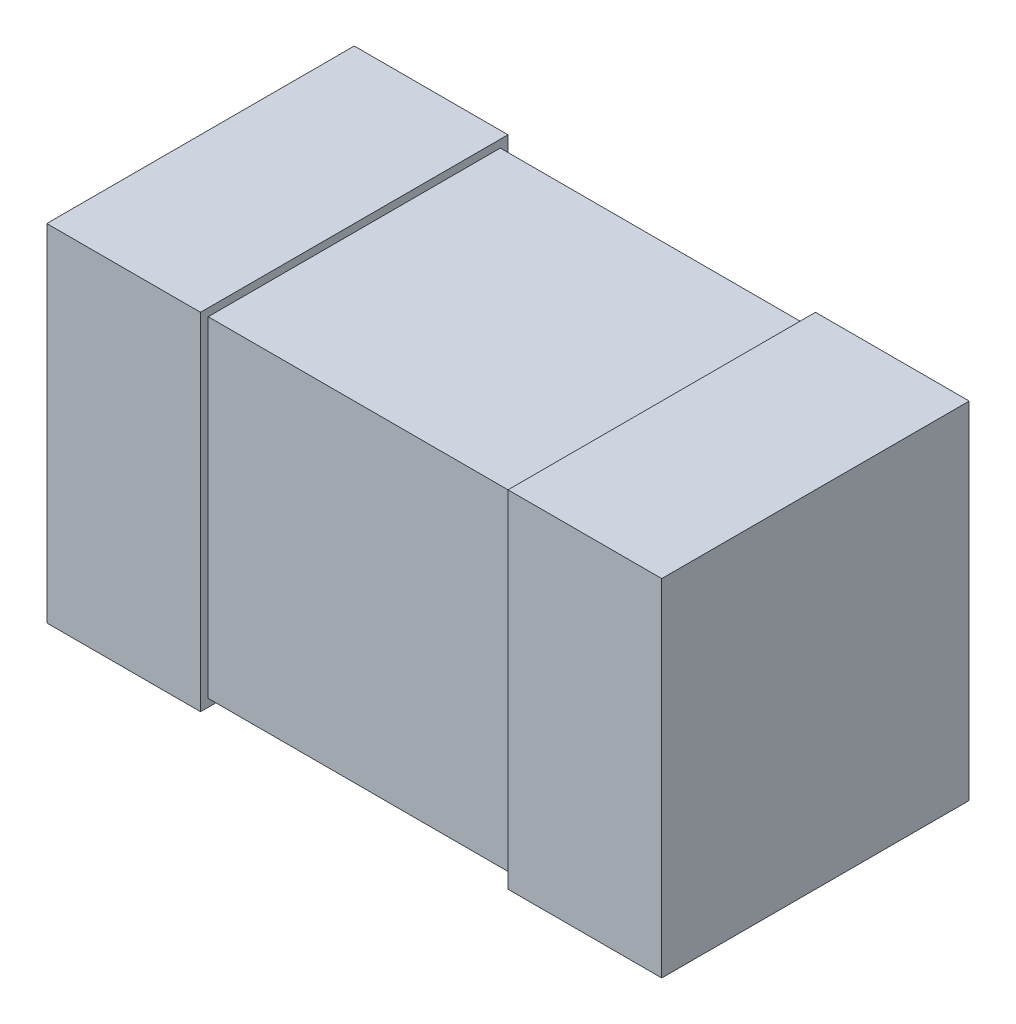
ISO-10303-21;
HEADER;
FILE_DESCRIPTION(('STEP AP214'),'2;1');
FILE_NAME('part.step','',(''),(''),'','','');
FILE_SCHEMA(('AUTOMOTIVE_DESIGN { 1 0 10303 214 1 1 1 1 }'));
ENDSEC;
DATA;
#1=APPLICATION_CONTEXT('core data for automotive mechanical design processes');
#2=APPLICATION_PROTOCOL_DEFINITION('international standard','automotive_design',2000,#1);
#3=PRODUCT_CONTEXT('',#1,'mechanical');
#4=PRODUCT('Part','Part','',(#3));
#5=PRODUCT_RELATED_PRODUCT_CATEGORY('part','',(#4));
#6=PRODUCT_DEFINITION_FORMATION('','',#4);
#7=PRODUCT_DEFINITION_CONTEXT('part definition',#1,'design');
#8=PRODUCT_DEFINITION('design','',#6,#7);
#9=PRODUCT_DEFINITION_SHAPE('','',#8);
#10=(LENGTH_UNIT() NAMED_UNIT(*) SI_UNIT(.MILLI.,.METRE.));
#11=(NAMED_UNIT(*) PLANE_ANGLE_UNIT() SI_UNIT($,.RADIAN.));
#12=(NAMED_UNIT(*) SI_UNIT($,.STERADIAN.) SOLID_ANGLE_UNIT());
#13=UNCERTAINTY_MEASURE_WITH_UNIT(LENGTH_MEASURE(1.E-05),#10,'distance_accuracy_value','');
#14=(GEOMETRIC_REPRESENTATION_CONTEXT(3) GLOBAL_UNCERTAINTY_ASSIGNED_CONTEXT((#13)) GLOBAL_UNIT_ASSIGNED_CONTEXT((#10,
#11,#12)) REPRESENTATION_CONTEXT('',''));
#15=CARTESIAN_POINT('',(0.,0.,0.));
#16=DIRECTION('',(0.,0.,1.));
#17=DIRECTION('',(1.,0.,0.));
#18=AXIS2_PLACEMENT_3D('',#15,#16,#17);
#19=CARTESIAN_POINT('',(-0.4,0.9,0.4));
#20=DIRECTION('',(-1.,0.,0.));
#21=DIRECTION('',(0.,0.,1.));
#22=AXIS2_PLACEMENT_3D('',#19,#20,#21);
#23=PLANE('',#22);
#24=DIRECTION('',(0.,0.,-1.));
#25=VECTOR('',#24,1.);
#26=CARTESIAN_POINT('',(-0.4,0.,0.4));
#27=LINE('',#26,#25);
#28=CARTESIAN_POINT('',(-0.4,0.,0.4));
#29=VERTEX_POINT('',#28);
#30=CARTESIAN_POINT('',(-0.4,0.,-0.4));
#31=VERTEX_POINT('',#30);
#32=EDGE_CURVE('E194',#29,#31,#27,.T.);
#33=ORIENTED_EDGE('',*,*,#32,.T.);
#34=DIRECTION('',(0.,-1.,0.));
#35=VECTOR('',#34,1.);
#36=CARTESIAN_POINT('',(-0.4,0.9,-0.4));
#37=LINE('',#36,#35);
#38=CARTESIAN_POINT('',(-0.4,0.9,-0.4));
#39=VERTEX_POINT('',#38);
#40=EDGE_CURVE('E199',#39,#31,#37,.T.);
#41=ORIENTED_EDGE('',*,*,#40,.F.);
#42=DIRECTION('',(0.,0.,-1.));
#43=VECTOR('',#42,1.);
#44=CARTESIAN_POINT('',(-0.4,0.9,0.4));
#45=LINE('',#44,#43);
#46=CARTESIAN_POINT('',(-0.4,0.9,0.4));
#47=VERTEX_POINT('',#46);
#48=EDGE_CURVE('E185',#47,#39,#45,.T.);
#49=ORIENTED_EDGE('',*,*,#48,.F.);
#50=DIRECTION('',(0.,-1.,0.));
#51=VECTOR('',#50,1.);
#52=CARTESIAN_POINT('',(-0.4,0.9,0.4));
#53=LINE('',#52,#51);
#54=EDGE_CURVE('E38',#47,#29,#53,.T.);
#55=ORIENTED_EDGE('',*,*,#54,.T.);
#56=EDGE_LOOP('',(#33,#41,#49,#55));
#57=FACE_BOUND('',#56,.T.);
#58=DIRECTION('',(0.,-1.,0.));
#59=VECTOR('',#58,1.);
#60=CARTESIAN_POINT('',(-0.4,0.88,0.38));
#61=LINE('',#60,#59);
#62=CARTESIAN_POINT('',(-0.4,0.88,0.38));
#63=VERTEX_POINT('',#62);
#64=CARTESIAN_POINT('',(-0.4,0.0200000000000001,0.38));
#65=VERTEX_POINT('',#64);
#66=EDGE_CURVE('E146',#63,#65,#61,.T.);
#67=ORIENTED_EDGE('',*,*,#66,.F.);
#68=DIRECTION('',(0.,0.,1.));
#69=VECTOR('',#68,1.);
#70=CARTESIAN_POINT('',(-0.4,0.88,-0.38));
#71=LINE('',#70,#69);
#72=CARTESIAN_POINT('',(-0.4,0.88,-0.38));
#73=VERTEX_POINT('',#72);
#74=EDGE_CURVE('E152',#73,#63,#71,.T.);
#75=ORIENTED_EDGE('',*,*,#74,.F.);
#76=DIRECTION('',(0.,1.,0.));
#77=VECTOR('',#76,1.);
#78=CARTESIAN_POINT('',(-0.4,0.0200000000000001,-0.38));
#79=LINE('',#78,#77);
#80=CARTESIAN_POINT('',(-0.4,0.0200000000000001,-0.38));
#81=VERTEX_POINT('',#80);
#82=EDGE_CURVE('E50',#81,#73,#79,.T.);
#83=ORIENTED_EDGE('',*,*,#82,.F.);
#84=DIRECTION('',(0.,0.,-1.));
#85=VECTOR('',#84,1.);
#86=CARTESIAN_POINT('',(-0.4,0.02,0.38));
#87=LINE('',#86,#85);
#88=EDGE_CURVE('E45',#65,#81,#87,.T.);
#89=ORIENTED_EDGE('',*,*,#88,.F.);
#90=EDGE_LOOP('',(#67,#75,#83,#89));
#91=FACE_BOUND('',#90,.T.);
#92=ADVANCED_FACE('F30',(#57,#91),#23,.F.);
#93=CARTESIAN_POINT('',(-0.8,0.9,0.4));
#94=DIRECTION('',(1.,0.,0.));
#95=DIRECTION('',(0.,0.,-1.));
#96=AXIS2_PLACEMENT_3D('',#93,#94,#95);
#97=PLANE('',#96);
#98=DIRECTION('',(0.,0.,1.));
#99=VECTOR('',#98,1.);
#100=CARTESIAN_POINT('',(-0.8,0.,0.4));
#101=LINE('',#100,#99);
#102=CARTESIAN_POINT('',(-0.8,0.,-0.4));
#103=VERTEX_POINT('',#102);
#104=CARTESIAN_POINT('',(-0.8,0.,0.4));
#105=VERTEX_POINT('',#104);
#106=EDGE_CURVE('E166',#103,#105,#101,.T.);
#107=ORIENTED_EDGE('',*,*,#106,.T.);
#108=DIRECTION('',(0.,-1.,0.));
#109=VECTOR('',#108,1.);
#110=CARTESIAN_POINT('',(-0.8,0.9,0.4));
#111=LINE('',#110,#109);
#112=CARTESIAN_POINT('',(-0.8,0.9,0.4));
#113=VERTEX_POINT('',#112);
#114=EDGE_CURVE('E11',#113,#105,#111,.T.);
#115=ORIENTED_EDGE('',*,*,#114,.F.);
#116=DIRECTION('',(0.,0.,1.));
#117=VECTOR('',#116,1.);
#118=CARTESIAN_POINT('',(-0.8,0.9,0.4));
#119=LINE('',#118,#117);
#120=CARTESIAN_POINT('',(-0.8,0.9,-0.4));
#121=VERTEX_POINT('',#120);
#122=EDGE_CURVE('E179',#121,#113,#119,.T.);
#123=ORIENTED_EDGE('',*,*,#122,.F.);
#124=DIRECTION('',(0.,-1.,0.));
#125=VECTOR('',#124,1.);
#126=CARTESIAN_POINT('',(-0.8,0.9,-0.4));
#127=LINE('',#126,#125);
#128=EDGE_CURVE('E189',#121,#103,#127,.T.);
#129=ORIENTED_EDGE('',*,*,#128,.T.);
#130=EDGE_LOOP('',(#107,#115,#123,#129));
#131=FACE_BOUND('',#130,.T.);
#132=ADVANCED_FACE('F32',(#131),#97,.F.);
#133=CARTESIAN_POINT('',(-0.8,0.9,0.4));
#134=DIRECTION('',(0.,0.,-1.));
#135=DIRECTION('',(-1.,0.,0.));
#136=AXIS2_PLACEMENT_3D('',#133,#134,#135);
#137=PLANE('',#136);
#138=DIRECTION('',(1.,0.,0.));
#139=VECTOR('',#138,1.);
#140=CARTESIAN_POINT('',(-0.8,0.,0.4));
#141=LINE('',#140,#139);
#142=EDGE_CURVE('E192',#105,#29,#141,.T.);
#143=ORIENTED_EDGE('',*,*,#142,.T.);
#144=ORIENTED_EDGE('',*,*,#54,.F.);
#145=DIRECTION('',(1.,0.,0.));
#146=VECTOR('',#145,1.);
#147=CARTESIAN_POINT('',(-0.8,0.9,0.4));
#148=LINE('',#147,#146);
#149=EDGE_CURVE('E182',#113,#47,#148,.T.);
#150=ORIENTED_EDGE('',*,*,#149,.F.);
#151=ORIENTED_EDGE('',*,*,#114,.T.);
#152=EDGE_LOOP('',(#143,#144,#150,#151));
#153=FACE_BOUND('',#152,.T.);
#154=ADVANCED_FACE('F221',(#153),#137,.F.);
#155=CARTESIAN_POINT('',(-0.8,0.9,-0.4));
#156=DIRECTION('',(0.,0.,1.));
#157=DIRECTION('',(1.,0.,0.));
#158=AXIS2_PLACEMENT_3D('',#155,#156,#157);
#159=PLANE('',#158);
#160=DIRECTION('',(-1.,0.,0.));
#161=VECTOR('',#160,1.);
#162=CARTESIAN_POINT('',(-0.8,0.,-0.4));
#163=LINE('',#162,#161);
#164=EDGE_CURVE('E183',#31,#103,#163,.T.);
#165=ORIENTED_EDGE('',*,*,#164,.T.);
#166=ORIENTED_EDGE('',*,*,#128,.F.);
#167=DIRECTION('',(-1.,0.,0.));
#168=VECTOR('',#167,1.);
#169=CARTESIAN_POINT('',(-0.8,0.9,-0.4));
#170=LINE('',#169,#168);
#171=EDGE_CURVE('E187',#39,#121,#170,.T.);
#172=ORIENTED_EDGE('',*,*,#171,.F.);
#173=ORIENTED_EDGE('',*,*,#40,.T.);
#174=EDGE_LOOP('',(#165,#166,#172,#173));
#175=FACE_BOUND('',#174,.T.);
#176=ADVANCED_FACE('F214',(#175),#159,.F.);
#177=CARTESIAN_POINT('',(-0.8,0.9,-0.4));
#178=DIRECTION('',(0.,-1.,0.));
#179=DIRECTION('',(0.,0.,-1.));
#180=AXIS2_PLACEMENT_3D('',#177,#178,#179);
#181=PLANE('',#180);
#182=ORIENTED_EDGE('',*,*,#122,.T.);
#183=ORIENTED_EDGE('',*,*,#149,.T.);
#184=ORIENTED_EDGE('',*,*,#48,.T.);
#185=ORIENTED_EDGE('',*,*,#171,.T.);
#186=EDGE_LOOP('',(#182,#183,#184,#185));
#187=FACE_BOUND('',#186,.T.);
#188=ADVANCED_FACE('F220',(#187),#181,.F.);
#189=CARTESIAN_POINT('',(-0.8,0.,-0.4));
#190=DIRECTION('',(0.,-1.,0.));
#191=DIRECTION('',(0.,0.,-1.));
#192=AXIS2_PLACEMENT_3D('',#189,#190,#191);
#193=PLANE('',#192);
#194=ORIENTED_EDGE('',*,*,#106,.F.);
#195=ORIENTED_EDGE('',*,*,#164,.F.);
#196=ORIENTED_EDGE('',*,*,#32,.F.);
#197=ORIENTED_EDGE('',*,*,#142,.F.);
#198=EDGE_LOOP('',(#194,#195,#196,#197));
#199=FACE_BOUND('',#198,.T.);
#200=ADVANCED_FACE('F211',(#199),#193,.T.);
#201=CARTESIAN_POINT('',(1.54769333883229,0.88,0.38));
#202=DIRECTION('',(0.,0.,-1.));
#203=DIRECTION('',(0.,1.,0.));
#204=AXIS2_PLACEMENT_3D('',#201,#202,#203);
#205=PLANE('',#204);
#206=DIRECTION('',(0.,-1.,0.));
#207=VECTOR('',#206,1.);
#208=CARTESIAN_POINT('',(0.4,0.88,0.38));
#209=LINE('',#208,#207);
#210=CARTESIAN_POINT('',(0.4,0.88,0.38));
#211=VERTEX_POINT('',#210);
#212=CARTESIAN_POINT('',(0.4,0.02,0.38));
#213=VERTEX_POINT('',#212);
#214=EDGE_CURVE('E170',#211,#213,#209,.T.);
#215=ORIENTED_EDGE('',*,*,#214,.F.);
#216=DIRECTION('',(-1.,0.,0.));
#217=VECTOR('',#216,1.);
#218=CARTESIAN_POINT('',(1.54769333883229,0.88,0.38));
#219=LINE('',#218,#217);
#220=EDGE_CURVE('E143',#211,#63,#219,.T.);
#221=ORIENTED_EDGE('',*,*,#220,.T.);
#222=ORIENTED_EDGE('',*,*,#66,.T.);
#223=DIRECTION('',(-1.,0.,0.));
#224=VECTOR('',#223,1.);
#225=CARTESIAN_POINT('',(1.54769333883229,0.02,0.38));
#226=LINE('',#225,#224);
#227=EDGE_CURVE('E160',#213,#65,#226,.T.);
#228=ORIENTED_EDGE('',*,*,#227,.F.);
#229=EDGE_LOOP('',(#215,#221,#222,#228));
#230=FACE_BOUND('',#229,.T.);
#231=ADVANCED_FACE('F235',(#230),#205,.F.);
#232=CARTESIAN_POINT('',(1.54769333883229,0.02,0.38));
#233=DIRECTION('',(0.,1.,0.));
#234=DIRECTION('',(0.,0.,1.));
#235=AXIS2_PLACEMENT_3D('',#232,#233,#234);
#236=PLANE('',#235);
#237=DIRECTION('',(0.,0.,-1.));
#238=VECTOR('',#237,1.);
#239=CARTESIAN_POINT('',(0.4,0.02,0.38));
#240=LINE('',#239,#238);
#241=CARTESIAN_POINT('',(0.4,0.0200000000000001,-0.38));
#242=VERTEX_POINT('',#241);
#243=EDGE_CURVE('E167',#213,#242,#240,.T.);
#244=ORIENTED_EDGE('',*,*,#243,.F.);
#245=ORIENTED_EDGE('',*,*,#227,.T.);
#246=ORIENTED_EDGE('',*,*,#88,.T.);
#247=DIRECTION('',(-1.,0.,0.));
#248=VECTOR('',#247,1.);
#249=CARTESIAN_POINT('',(1.54769333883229,0.0200000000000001,-0.38));
#250=LINE('',#249,#248);
#251=EDGE_CURVE('E158',#242,#81,#250,.T.);
#252=ORIENTED_EDGE('',*,*,#251,.F.);
#253=EDGE_LOOP('',(#244,#245,#246,#252));
#254=FACE_BOUND('',#253,.T.);
#255=ADVANCED_FACE('F240',(#254),#236,.F.);
#256=CARTESIAN_POINT('',(1.54769333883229,0.0200000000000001,-0.38));
#257=DIRECTION('',(0.,0.,1.));
#258=DIRECTION('',(1.,0.,0.));
#259=AXIS2_PLACEMENT_3D('',#256,#257,#258);
#260=PLANE('',#259);
#261=DIRECTION('',(0.,1.,0.));
#262=VECTOR('',#261,1.);
#263=CARTESIAN_POINT('',(0.4,0.0200000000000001,-0.38));
#264=LINE('',#263,#262);
#265=CARTESIAN_POINT('',(0.4,0.88,-0.38));
#266=VERTEX_POINT('',#265);
#267=EDGE_CURVE('E163',#242,#266,#264,.T.);
#268=ORIENTED_EDGE('',*,*,#267,.F.);
#269=ORIENTED_EDGE('',*,*,#251,.T.);
#270=ORIENTED_EDGE('',*,*,#82,.T.);
#271=DIRECTION('',(-1.,0.,0.));
#272=VECTOR('',#271,1.);
#273=CARTESIAN_POINT('',(1.54769333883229,0.88,-0.38));
#274=LINE('',#273,#272);
#275=EDGE_CURVE('E156',#266,#73,#274,.T.);
#276=ORIENTED_EDGE('',*,*,#275,.F.);
#277=EDGE_LOOP('',(#268,#269,#270,#276));
#278=FACE_BOUND('',#277,.T.);
#279=ADVANCED_FACE('F244',(#278),#260,.F.);
#280=CARTESIAN_POINT('',(1.54769333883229,0.88,-0.38));
#281=DIRECTION('',(0.,-1.,0.));
#282=DIRECTION('',(0.,0.,-1.));
#283=AXIS2_PLACEMENT_3D('',#280,#281,#282);
#284=PLANE('',#283);
#285=DIRECTION('',(0.,0.,1.));
#286=VECTOR('',#285,1.);
#287=CARTESIAN_POINT('',(0.4,0.88,-0.38));
#288=LINE('',#287,#286);
#289=EDGE_CURVE('E155',#266,#211,#288,.T.);
#290=ORIENTED_EDGE('',*,*,#289,.F.);
#291=ORIENTED_EDGE('',*,*,#275,.T.);
#292=ORIENTED_EDGE('',*,*,#74,.T.);
#293=ORIENTED_EDGE('',*,*,#220,.F.);
#294=EDGE_LOOP('',(#290,#291,#292,#293));
#295=FACE_BOUND('',#294,.T.);
#296=ADVANCED_FACE('F248',(#295),#284,.F.);
#297=CARTESIAN_POINT('',(0.4,0.9,0.4));
#298=DIRECTION('',(1.,0.,0.));
#299=DIRECTION('',(0.,0.,-1.));
#300=AXIS2_PLACEMENT_3D('',#297,#298,#299);
#301=PLANE('',#300);
#302=DIRECTION('',(0.,0.,1.));
#303=VECTOR('',#302,1.);
#304=CARTESIAN_POINT('',(0.4,0.,0.4));
#305=LINE('',#304,#303);
#306=CARTESIAN_POINT('',(0.4,0.,-0.4));
#307=VERTEX_POINT('',#306);
#308=CARTESIAN_POINT('',(0.4,0.,0.4));
#309=VERTEX_POINT('',#308);
#310=EDGE_CURVE('E138',#307,#309,#305,.T.);
#311=ORIENTED_EDGE('',*,*,#310,.T.);
#312=DIRECTION('',(0.,-1.,0.));
#313=VECTOR('',#312,1.);
#314=CARTESIAN_POINT('',(0.4,0.9,0.4));
#315=LINE('',#314,#313);
#316=CARTESIAN_POINT('',(0.4,0.9,0.4));
#317=VERTEX_POINT('',#316);
#318=EDGE_CURVE('E373',#317,#309,#315,.T.);
#319=ORIENTED_EDGE('',*,*,#318,.F.);
#320=DIRECTION('',(0.,0.,1.));
#321=VECTOR('',#320,1.);
#322=CARTESIAN_POINT('',(0.4,0.9,0.4));
#323=LINE('',#322,#321);
#324=CARTESIAN_POINT('',(0.4,0.9,-0.4));
#325=VERTEX_POINT('',#324);
#326=EDGE_CURVE('E134',#325,#317,#323,.T.);
#327=ORIENTED_EDGE('',*,*,#326,.F.);
#328=DIRECTION('',(0.,-1.,0.));
#329=VECTOR('',#328,1.);
#330=CARTESIAN_POINT('',(0.4,0.9,-0.4));
#331=LINE('',#330,#329);
#332=EDGE_CURVE('E148',#325,#307,#331,.T.);
#333=ORIENTED_EDGE('',*,*,#332,.T.);
#334=EDGE_LOOP('',(#311,#319,#327,#333));
#335=FACE_BOUND('',#334,.T.);
#336=ORIENTED_EDGE('',*,*,#289,.T.);
#337=ORIENTED_EDGE('',*,*,#214,.T.);
#338=ORIENTED_EDGE('',*,*,#243,.T.);
#339=ORIENTED_EDGE('',*,*,#267,.T.);
#340=EDGE_LOOP('',(#336,#337,#338,#339));
#341=FACE_BOUND('',#340,.T.);
#342=ADVANCED_FACE('F252',(#335,#341),#301,.F.);
#343=CARTESIAN_POINT('',(0.8,0.9,0.4));
#344=DIRECTION('',(0.,0.,-1.));
#345=DIRECTION('',(-1.,0.,0.));
#346=AXIS2_PLACEMENT_3D('',#343,#344,#345);
#347=PLANE('',#346);
#348=DIRECTION('',(1.,0.,0.));
#349=VECTOR('',#348,1.);
#350=CARTESIAN_POINT('',(0.8,0.,0.4));
#351=LINE('',#350,#349);
#352=CARTESIAN_POINT('',(0.8,0.,0.4));
#353=VERTEX_POINT('',#352);
#354=EDGE_CURVE('E142',#309,#353,#351,.T.);
#355=ORIENTED_EDGE('',*,*,#354,.T.);
#356=DIRECTION('',(0.,-1.,0.));
#357=VECTOR('',#356,1.);
#358=CARTESIAN_POINT('',(0.8,0.9,0.4));
#359=LINE('',#358,#357);
#360=CARTESIAN_POINT('',(0.8,0.9,0.4));
#361=VERTEX_POINT('',#360);
#362=EDGE_CURVE('E122',#361,#353,#359,.T.);
#363=ORIENTED_EDGE('',*,*,#362,.F.);
#364=DIRECTION('',(1.,0.,0.));
#365=VECTOR('',#364,1.);
#366=CARTESIAN_POINT('',(0.8,0.9,0.4));
#367=LINE('',#366,#365);
#368=EDGE_CURVE('E129',#317,#361,#367,.T.);
#369=ORIENTED_EDGE('',*,*,#368,.F.);
#370=ORIENTED_EDGE('',*,*,#318,.T.);
#371=EDGE_LOOP('',(#355,#363,#369,#370));
#372=FACE_BOUND('',#371,.T.);
#373=ADVANCED_FACE('F140',(#372),#347,.F.);
#374=CARTESIAN_POINT('',(0.8,0.9,0.4));
#375=DIRECTION('',(-1.,0.,0.));
#376=DIRECTION('',(0.,0.,1.));
#377=AXIS2_PLACEMENT_3D('',#374,#375,#376);
#378=PLANE('',#377);
#379=DIRECTION('',(0.,0.,-1.));
#380=VECTOR('',#379,1.);
#381=CARTESIAN_POINT('',(0.8,0.,0.4));
#382=LINE('',#381,#380);
#383=CARTESIAN_POINT('',(0.8,0.,-0.4));
#384=VERTEX_POINT('',#383);
#385=EDGE_CURVE('E364',#353,#384,#382,.T.);
#386=ORIENTED_EDGE('',*,*,#385,.T.);
#387=DIRECTION('',(0.,-1.,0.));
#388=VECTOR('',#387,1.);
#389=CARTESIAN_POINT('',(0.8,0.9,-0.4));
#390=LINE('',#389,#388);
#391=CARTESIAN_POINT('',(0.8,0.9,-0.4));
#392=VERTEX_POINT('',#391);
#393=EDGE_CURVE('E125',#392,#384,#390,.T.);
#394=ORIENTED_EDGE('',*,*,#393,.F.);
#395=DIRECTION('',(0.,0.,-1.));
#396=VECTOR('',#395,1.);
#397=CARTESIAN_POINT('',(0.8,0.9,0.4));
#398=LINE('',#397,#396);
#399=EDGE_CURVE('E118',#361,#392,#398,.T.);
#400=ORIENTED_EDGE('',*,*,#399,.F.);
#401=ORIENTED_EDGE('',*,*,#362,.T.);
#402=EDGE_LOOP('',(#386,#394,#400,#401));
#403=FACE_BOUND('',#402,.T.);
#404=ADVANCED_FACE('F120',(#403),#378,.F.);
#405=CARTESIAN_POINT('',(0.8,0.9,-0.4));
#406=DIRECTION('',(0.,0.,1.));
#407=DIRECTION('',(1.,0.,0.));
#408=AXIS2_PLACEMENT_3D('',#405,#406,#407);
#409=PLANE('',#408);
#410=DIRECTION('',(-1.,0.,0.));
#411=VECTOR('',#410,1.);
#412=CARTESIAN_POINT('',(0.8,0.,-0.4));
#413=LINE('',#412,#411);
#414=EDGE_CURVE('E366',#384,#307,#413,.T.);
#415=ORIENTED_EDGE('',*,*,#414,.T.);
#416=ORIENTED_EDGE('',*,*,#332,.F.);
#417=DIRECTION('',(-1.,0.,0.));
#418=VECTOR('',#417,1.);
#419=CARTESIAN_POINT('',(0.8,0.9,-0.4));
#420=LINE('',#419,#418);
#421=EDGE_CURVE('E128',#392,#325,#420,.T.);
#422=ORIENTED_EDGE('',*,*,#421,.F.);
#423=ORIENTED_EDGE('',*,*,#393,.T.);
#424=EDGE_LOOP('',(#415,#416,#422,#423));
#425=FACE_BOUND('',#424,.T.);
#426=ADVANCED_FACE('F258',(#425),#409,.F.);
#427=CARTESIAN_POINT('',(0.4,0.9,0.4));
#428=DIRECTION('',(0.,-1.,0.));
#429=DIRECTION('',(0.,0.,-1.));
#430=AXIS2_PLACEMENT_3D('',#427,#428,#429);
#431=PLANE('',#430);
#432=ORIENTED_EDGE('',*,*,#368,.T.);
#433=ORIENTED_EDGE('',*,*,#399,.T.);
#434=ORIENTED_EDGE('',*,*,#421,.T.);
#435=ORIENTED_EDGE('',*,*,#326,.T.);
#436=EDGE_LOOP('',(#432,#433,#434,#435));
#437=FACE_BOUND('',#436,.T.);
#438=ADVANCED_FACE('F132',(#437),#431,.F.);
#439=CARTESIAN_POINT('',(0.4,0.,0.4));
#440=DIRECTION('',(0.,-1.,0.));
#441=DIRECTION('',(0.,0.,-1.));
#442=AXIS2_PLACEMENT_3D('',#439,#440,#441);
#443=PLANE('',#442);
#444=ORIENTED_EDGE('',*,*,#354,.F.);
#445=ORIENTED_EDGE('',*,*,#310,.F.);
#446=ORIENTED_EDGE('',*,*,#414,.F.);
#447=ORIENTED_EDGE('',*,*,#385,.F.);
#448=EDGE_LOOP('',(#444,#445,#446,#447));
#449=FACE_BOUND('',#448,.T.);
#450=ADVANCED_FACE('F265',(#449),#443,.T.);
#451=CLOSED_SHELL('',(#92,#132,#154,#176,#188,#200,#231,#255,#279,#296,#342,#373,#404,#426,#438,#450));
#452=MANIFOLD_SOLID_BREP('B2',#451);
#453=ADVANCED_BREP_SHAPE_REPRESENTATION('',(#18,#452),#14);
#454=SHAPE_DEFINITION_REPRESENTATION(#9,#453);
ENDSEC;
END-ISO-10303-21;
